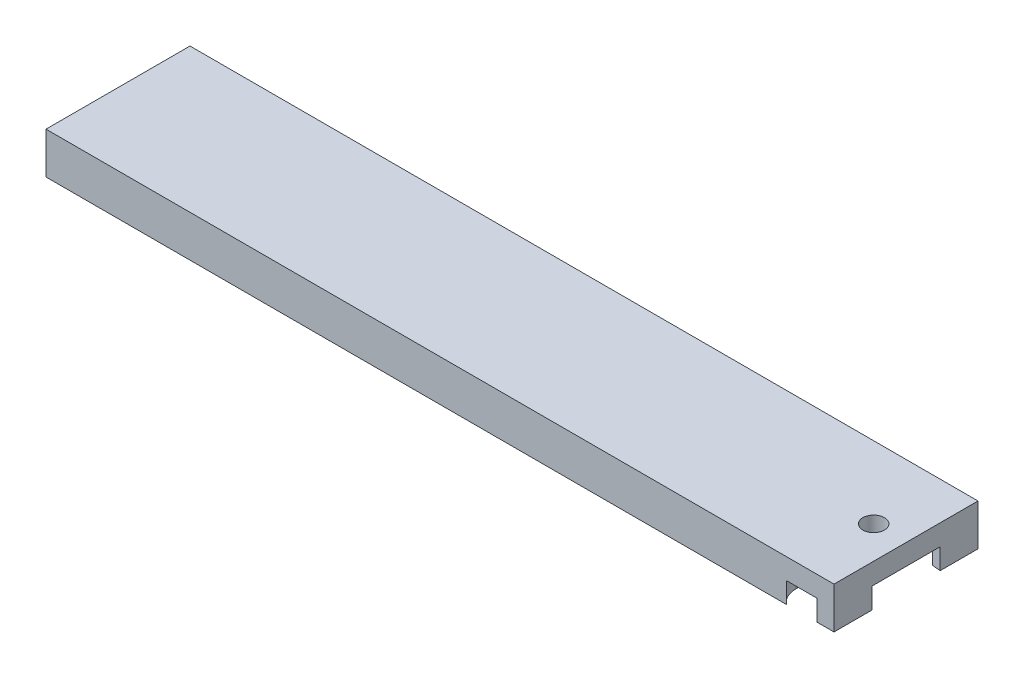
ISO-10303-21;
HEADER;
FILE_DESCRIPTION(('STEP AP214'),'2;1');
FILE_NAME('part.step','',(''),(''),'','','');
FILE_SCHEMA(('AUTOMOTIVE_DESIGN { 1 0 10303 214 1 1 1 1 }'));
ENDSEC;
DATA;
#1=APPLICATION_CONTEXT('core data for automotive mechanical design processes');
#2=APPLICATION_PROTOCOL_DEFINITION('international standard','automotive_design',2000,#1);
#3=PRODUCT_CONTEXT('',#1,'mechanical');
#4=PRODUCT('Part','Part','',(#3));
#5=PRODUCT_RELATED_PRODUCT_CATEGORY('part','',(#4));
#6=PRODUCT_DEFINITION_FORMATION('','',#4);
#7=PRODUCT_DEFINITION_CONTEXT('part definition',#1,'design');
#8=PRODUCT_DEFINITION('design','',#6,#7);
#9=PRODUCT_DEFINITION_SHAPE('','',#8);
#10=(LENGTH_UNIT() NAMED_UNIT(*) SI_UNIT(.MILLI.,.METRE.));
#11=(NAMED_UNIT(*) PLANE_ANGLE_UNIT() SI_UNIT($,.RADIAN.));
#12=(NAMED_UNIT(*) SI_UNIT($,.STERADIAN.) SOLID_ANGLE_UNIT());
#13=UNCERTAINTY_MEASURE_WITH_UNIT(LENGTH_MEASURE(1.E-05),#10,'distance_accuracy_value','');
#14=(GEOMETRIC_REPRESENTATION_CONTEXT(3) GLOBAL_UNCERTAINTY_ASSIGNED_CONTEXT((#13)) GLOBAL_UNIT_ASSIGNED_CONTEXT((#10,
#11,#12)) REPRESENTATION_CONTEXT('',''));
#15=CARTESIAN_POINT('',(0.,0.,0.));
#16=DIRECTION('',(0.,0.,1.));
#17=DIRECTION('',(1.,0.,0.));
#18=AXIS2_PLACEMENT_3D('',#15,#16,#17);
#19=CARTESIAN_POINT('',(0.,5.,-6.45));
#20=DIRECTION('',(0.,-1.,0.));
#21=DIRECTION('',(0.,0.,-1.));
#22=AXIS2_PLACEMENT_3D('',#19,#20,#21);
#23=CYLINDRICAL_SURFACE('',#22,2.9);
#24=DIRECTION('',(0.,-1.,0.));
#25=VECTOR('',#24,1.);
#26=CARTESIAN_POINT('',(-1.85415226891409,5.,-8.67982496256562));
#27=LINE('',#26,#25);
#28=CARTESIAN_POINT('',(-1.85415226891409,2.5,-8.67982496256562));
#29=VERTEX_POINT('',#28);
#30=CARTESIAN_POINT('',(-1.85415226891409,0.,-8.67982496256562));
#31=VERTEX_POINT('',#30);
#32=EDGE_CURVE('E278',#29,#31,#27,.T.);
#33=ORIENTED_EDGE('',*,*,#32,.F.);
#34=CARTESIAN_POINT('',(0.,2.5,-6.45));
#35=DIRECTION('',(0.,1.,0.));
#36=DIRECTION('',(0.,0.,1.));
#37=AXIS2_PLACEMENT_3D('',#34,#35,#36);
#38=CIRCLE('',#37,2.9);
#39=CARTESIAN_POINT('',(-2.9,2.5,-6.45));
#40=VERTEX_POINT('',#39);
#41=EDGE_CURVE('E232',#29,#40,#38,.T.);
#42=ORIENTED_EDGE('',*,*,#41,.T.);
#43=DIRECTION('',(0.,-1.,0.));
#44=VECTOR('',#43,1.);
#45=CARTESIAN_POINT('',(-2.9,5.,-6.45));
#46=LINE('',#45,#44);
#47=CARTESIAN_POINT('',(-2.9,0.,-6.45));
#48=VERTEX_POINT('',#47);
#49=EDGE_CURVE('E242',#40,#48,#46,.T.);
#50=ORIENTED_EDGE('',*,*,#49,.T.);
#51=CARTESIAN_POINT('',(0.,0.,-6.45));
#52=DIRECTION('',(0.,1.,0.));
#53=DIRECTION('',(0.,0.,1.));
#54=AXIS2_PLACEMENT_3D('',#51,#52,#53);
#55=CIRCLE('',#54,2.9);
#56=EDGE_CURVE('E234',#31,#48,#55,.T.);
#57=ORIENTED_EDGE('',*,*,#56,.F.);
#58=EDGE_LOOP('',(#33,#42,#50,#57));
#59=FACE_BOUND('',#58,.T.);
#60=ADVANCED_FACE('F43',(#59),#23,.F.);
#61=CARTESIAN_POINT('',(0.,5.,6.45));
#62=DIRECTION('',(0.,-1.,0.));
#63=DIRECTION('',(0.,0.,-1.));
#64=AXIS2_PLACEMENT_3D('',#61,#62,#63);
#65=CYLINDRICAL_SURFACE('',#64,2.9);
#66=DIRECTION('',(0.,-1.,0.));
#67=VECTOR('',#66,1.);
#68=CARTESIAN_POINT('',(-2.9,5.,6.45));
#69=LINE('',#68,#67);
#70=CARTESIAN_POINT('',(-2.9,2.5,6.45));
#71=VERTEX_POINT('',#70);
#72=CARTESIAN_POINT('',(-2.9,0.,6.45));
#73=VERTEX_POINT('',#72);
#74=EDGE_CURVE('E268',#71,#73,#69,.T.);
#75=ORIENTED_EDGE('',*,*,#74,.F.);
#76=CARTESIAN_POINT('',(0.,2.5,6.45));
#77=DIRECTION('',(0.,1.,0.));
#78=DIRECTION('',(0.,0.,1.));
#79=AXIS2_PLACEMENT_3D('',#76,#77,#78);
#80=CIRCLE('',#79,2.9);
#81=CARTESIAN_POINT('',(-1.85415226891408,2.5,8.67982496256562));
#82=VERTEX_POINT('',#81);
#83=EDGE_CURVE('E230',#71,#82,#80,.T.);
#84=ORIENTED_EDGE('',*,*,#83,.T.);
#85=DIRECTION('',(0.,-1.,0.));
#86=VECTOR('',#85,1.);
#87=CARTESIAN_POINT('',(-1.85415226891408,5.,8.67982496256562));
#88=LINE('',#87,#86);
#89=CARTESIAN_POINT('',(-1.85415226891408,0.,8.67982496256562));
#90=VERTEX_POINT('',#89);
#91=EDGE_CURVE('E270',#82,#90,#88,.T.);
#92=ORIENTED_EDGE('',*,*,#91,.T.);
#93=CARTESIAN_POINT('',(0.,0.,6.45));
#94=DIRECTION('',(0.,1.,0.));
#95=DIRECTION('',(0.,0.,1.));
#96=AXIS2_PLACEMENT_3D('',#93,#94,#95);
#97=CIRCLE('',#96,2.9);
#98=EDGE_CURVE('E252',#73,#90,#97,.T.);
#99=ORIENTED_EDGE('',*,*,#98,.F.);
#100=EDGE_LOOP('',(#75,#84,#92,#99));
#101=FACE_BOUND('',#100,.T.);
#102=ADVANCED_FACE('F395',(#101),#65,.F.);
#103=CARTESIAN_POINT('',(-2.9,5.,0.));
#104=DIRECTION('',(1.,0.,0.));
#105=DIRECTION('',(0.,0.,-1.));
#106=AXIS2_PLACEMENT_3D('',#103,#104,#105);
#107=PLANE('',#106);
#108=DIRECTION('',(0.,-1.,0.));
#109=VECTOR('',#108,1.);
#110=CARTESIAN_POINT('',(-2.9,5.,3.61373784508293));
#111=LINE('',#110,#109);
#112=CARTESIAN_POINT('',(-2.9,2.5,3.61373784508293));
#113=VERTEX_POINT('',#112);
#114=CARTESIAN_POINT('',(-2.9,0.,3.61373784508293));
#115=VERTEX_POINT('',#114);
#116=EDGE_CURVE('E266',#113,#115,#111,.T.);
#117=ORIENTED_EDGE('',*,*,#116,.F.);
#118=DIRECTION('',(0.,0.,1.));
#119=VECTOR('',#118,1.);
#120=CARTESIAN_POINT('',(-2.9,2.5,0.));
#121=LINE('',#120,#119);
#122=EDGE_CURVE('E228',#113,#71,#121,.T.);
#123=ORIENTED_EDGE('',*,*,#122,.T.);
#124=ORIENTED_EDGE('',*,*,#74,.T.);
#125=DIRECTION('',(0.,0.,1.));
#126=VECTOR('',#125,1.);
#127=CARTESIAN_POINT('',(-2.9,0.,0.));
#128=LINE('',#127,#126);
#129=EDGE_CURVE('E255',#115,#73,#128,.T.);
#130=ORIENTED_EDGE('',*,*,#129,.F.);
#131=EDGE_LOOP('',(#117,#123,#124,#130));
#132=FACE_BOUND('',#131,.T.);
#133=ADVANCED_FACE('F399',(#132),#107,.T.);
#134=CARTESIAN_POINT('',(-0.205508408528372,5.,3.76097126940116));
#135=DIRECTION('',(0.0545609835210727,0.,-0.998510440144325));
#136=DIRECTION('',(-0.998510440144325,0.,-0.0545609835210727));
#137=AXIS2_PLACEMENT_3D('',#134,#135,#136);
#138=PLANE('',#137);
#139=DIRECTION('',(0.998510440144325,0.,0.0545609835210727));
#140=VECTOR('',#139,1.);
#141=CARTESIAN_POINT('',(-0.205508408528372,0.,3.76097126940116));
#142=LINE('',#141,#140);
#143=CARTESIAN_POINT('',(-21.7136829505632,0.,2.58571349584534));
#144=VERTEX_POINT('',#143);
#145=EDGE_CURVE('E258',#144,#115,#142,.T.);
#146=ORIENTED_EDGE('',*,*,#145,.F.);
#147=DIRECTION('',(0.,-1.,0.));
#148=VECTOR('',#147,1.);
#149=CARTESIAN_POINT('',(-21.7136829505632,14.2309184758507,2.58571349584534));
#150=LINE('',#149,#148);
#151=CARTESIAN_POINT('',(-21.7136829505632,2.5,2.58571349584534));
#152=VERTEX_POINT('',#151);
#153=EDGE_CURVE('E362',#152,#144,#150,.T.);
#154=ORIENTED_EDGE('',*,*,#153,.F.);
#155=DIRECTION('',(0.998510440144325,0.,0.0545609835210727));
#156=VECTOR('',#155,1.);
#157=CARTESIAN_POINT('',(-0.205508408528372,2.5,3.76097126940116));
#158=LINE('',#157,#156);
#159=EDGE_CURVE('E226',#152,#113,#158,.T.);
#160=ORIENTED_EDGE('',*,*,#159,.T.);
#161=ORIENTED_EDGE('',*,*,#116,.T.);
#162=EDGE_LOOP('',(#146,#154,#160,#161));
#163=FACE_BOUND('',#162,.T.);
#164=ADVANCED_FACE('F406',(#163),#138,.T.);
#165=CARTESIAN_POINT('',(-0.205508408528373,5.,-3.76097126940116));
#166=DIRECTION('',(0.0545609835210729,0.,0.998510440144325));
#167=DIRECTION('',(0.998510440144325,0.,-0.0545609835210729));
#168=AXIS2_PLACEMENT_3D('',#165,#166,#167);
#169=PLANE('',#168);
#170=DIRECTION('',(0.,-1.,0.));
#171=VECTOR('',#170,1.);
#172=CARTESIAN_POINT('',(-2.9,5.,-3.61373784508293));
#173=LINE('',#172,#171);
#174=CARTESIAN_POINT('',(-2.9,2.5,-3.61373784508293));
#175=VERTEX_POINT('',#174);
#176=CARTESIAN_POINT('',(-2.9,0.,-3.61373784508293));
#177=VERTEX_POINT('',#176);
#178=EDGE_CURVE('E264',#175,#177,#173,.T.);
#179=ORIENTED_EDGE('',*,*,#178,.F.);
#180=DIRECTION('',(-0.998510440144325,0.,0.0545609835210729));
#181=VECTOR('',#180,1.);
#182=CARTESIAN_POINT('',(-0.205508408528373,2.5,-3.76097126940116));
#183=LINE('',#182,#181);
#184=CARTESIAN_POINT('',(-21.7136829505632,2.5,-2.58571349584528));
#185=VERTEX_POINT('',#184);
#186=EDGE_CURVE('E224',#175,#185,#183,.T.);
#187=ORIENTED_EDGE('',*,*,#186,.T.);
#188=DIRECTION('',(0.,-1.,0.));
#189=VECTOR('',#188,1.);
#190=CARTESIAN_POINT('',(-21.7136829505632,14.2309184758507,-2.58571349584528));
#191=LINE('',#190,#189);
#192=CARTESIAN_POINT('',(-21.7136829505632,0.,-2.58571349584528));
#193=VERTEX_POINT('',#192);
#194=EDGE_CURVE('E347',#185,#193,#191,.T.);
#195=ORIENTED_EDGE('',*,*,#194,.T.);
#196=DIRECTION('',(-0.998510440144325,0.,0.0545609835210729));
#197=VECTOR('',#196,1.);
#198=CARTESIAN_POINT('',(-0.205508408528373,0.,-3.76097126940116));
#199=LINE('',#198,#197);
#200=EDGE_CURVE('E66',#177,#193,#199,.T.);
#201=ORIENTED_EDGE('',*,*,#200,.F.);
#202=EDGE_LOOP('',(#179,#187,#195,#201));
#203=FACE_BOUND('',#202,.T.);
#204=ADVANCED_FACE('F344',(#203),#169,.T.);
#205=CARTESIAN_POINT('',(-2.9,5.,0.));
#206=DIRECTION('',(1.,0.,0.));
#207=DIRECTION('',(0.,0.,-1.));
#208=AXIS2_PLACEMENT_3D('',#205,#206,#207);
#209=PLANE('',#208);
#210=ORIENTED_EDGE('',*,*,#49,.F.);
#211=DIRECTION('',(0.,0.,1.));
#212=VECTOR('',#211,1.);
#213=CARTESIAN_POINT('',(-2.9,2.5,0.));
#214=LINE('',#213,#212);
#215=EDGE_CURVE('E280',#40,#175,#214,.T.);
#216=ORIENTED_EDGE('',*,*,#215,.T.);
#217=ORIENTED_EDGE('',*,*,#178,.T.);
#218=DIRECTION('',(0.,0.,1.));
#219=VECTOR('',#218,1.);
#220=CARTESIAN_POINT('',(-2.9,0.,0.));
#221=LINE('',#220,#219);
#222=EDGE_CURVE('E237',#48,#177,#221,.T.);
#223=ORIENTED_EDGE('',*,*,#222,.F.);
#224=EDGE_LOOP('',(#210,#216,#217,#223));
#225=FACE_BOUND('',#224,.T.);
#226=ADVANCED_FACE('F341',(#225),#209,.T.);
#227=CARTESIAN_POINT('',(0.,5.,-8.67982496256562));
#228=DIRECTION('',(0.,0.,1.));
#229=DIRECTION('',(1.,0.,0.));
#230=AXIS2_PLACEMENT_3D('',#227,#228,#229);
#231=PLANE('',#230);
#232=DIRECTION('',(-1.,0.,0.));
#233=VECTOR('',#232,1.);
#234=CARTESIAN_POINT('',(0.,5.,-8.67982496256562));
#235=LINE('',#234,#233);
#236=CARTESIAN_POINT('',(3.9,5.,-8.67982496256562));
#237=VERTEX_POINT('',#236);
#238=CARTESIAN_POINT('',(-91.1,5.,-8.6798249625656));
#239=VERTEX_POINT('',#238);
#240=EDGE_CURVE('E198',#237,#239,#235,.T.);
#241=ORIENTED_EDGE('',*,*,#240,.F.);
#242=DIRECTION('',(0.,-1.,0.));
#243=VECTOR('',#242,1.);
#244=CARTESIAN_POINT('',(3.9,10.,-8.67982496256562));
#245=LINE('',#244,#243);
#246=CARTESIAN_POINT('',(3.9,0.,-8.67982496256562));
#247=VERTEX_POINT('',#246);
#248=EDGE_CURVE('E183',#237,#247,#245,.T.);
#249=ORIENTED_EDGE('',*,*,#248,.T.);
#250=DIRECTION('',(-1.,0.,0.));
#251=VECTOR('',#250,1.);
#252=CARTESIAN_POINT('',(0.,0.,-8.67982496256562));
#253=LINE('',#252,#251);
#254=CARTESIAN_POINT('',(1.85415226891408,0.,-8.67982496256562));
#255=VERTEX_POINT('',#254);
#256=EDGE_CURVE('E195',#247,#255,#253,.T.);
#257=ORIENTED_EDGE('',*,*,#256,.T.);
#258=DIRECTION('',(0.,-1.,0.));
#259=VECTOR('',#258,1.);
#260=CARTESIAN_POINT('',(1.85415226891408,5.,-8.67982496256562));
#261=LINE('',#260,#259);
#262=CARTESIAN_POINT('',(1.85415226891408,2.5,-8.6798249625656));
#263=VERTEX_POINT('',#262);
#264=EDGE_CURVE('E206',#263,#255,#261,.T.);
#265=ORIENTED_EDGE('',*,*,#264,.F.);
#266=DIRECTION('',(-1.,0.,0.));
#267=VECTOR('',#266,1.);
#268=CARTESIAN_POINT('',(-91.1,2.5,-8.6798249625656));
#269=LINE('',#268,#267);
#270=EDGE_CURVE('E222',#263,#29,#269,.T.);
#271=ORIENTED_EDGE('',*,*,#270,.T.);
#272=ORIENTED_EDGE('',*,*,#32,.T.);
#273=DIRECTION('',(-1.,0.,0.));
#274=VECTOR('',#273,1.);
#275=CARTESIAN_POINT('',(0.,0.,-8.67982496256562));
#276=LINE('',#275,#274);
#277=CARTESIAN_POINT('',(-91.1,0.,-8.6798249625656));
#278=VERTEX_POINT('',#277);
#279=EDGE_CURVE('E245',#31,#278,#276,.T.);
#280=ORIENTED_EDGE('',*,*,#279,.T.);
#281=DIRECTION('',(0.,-1.,0.));
#282=VECTOR('',#281,1.);
#283=CARTESIAN_POINT('',(-91.1,5.,-8.6798249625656));
#284=LINE('',#283,#282);
#285=EDGE_CURVE('E275',#239,#278,#284,.T.);
#286=ORIENTED_EDGE('',*,*,#285,.F.);
#287=EDGE_LOOP('',(#241,#249,#257,#265,#271,#272,#280,#286));
#288=FACE_BOUND('',#287,.T.);
#289=ADVANCED_FACE('F194',(#288),#231,.F.);
#290=CARTESIAN_POINT('',(-91.1,5.,0.));
#291=DIRECTION('',(1.,0.,0.));
#292=DIRECTION('',(0.,0.,-1.));
#293=AXIS2_PLACEMENT_3D('',#290,#291,#292);
#294=PLANE('',#293);
#295=ORIENTED_EDGE('',*,*,#285,.T.);
#296=DIRECTION('',(0.,0.,1.));
#297=VECTOR('',#296,1.);
#298=CARTESIAN_POINT('',(-91.1,0.,0.));
#299=LINE('',#298,#297);
#300=CARTESIAN_POINT('',(-91.1,0.,8.67982496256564));
#301=VERTEX_POINT('',#300);
#302=EDGE_CURVE('E247',#278,#301,#299,.T.);
#303=ORIENTED_EDGE('',*,*,#302,.T.);
#304=DIRECTION('',(0.,-1.,0.));
#305=VECTOR('',#304,1.);
#306=CARTESIAN_POINT('',(-91.1,5.,8.67982496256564));
#307=LINE('',#306,#305);
#308=CARTESIAN_POINT('',(-91.1,5.,8.67982496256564));
#309=VERTEX_POINT('',#308);
#310=EDGE_CURVE('E273',#309,#301,#307,.T.);
#311=ORIENTED_EDGE('',*,*,#310,.F.);
#312=DIRECTION('',(0.,0.,1.));
#313=VECTOR('',#312,1.);
#314=CARTESIAN_POINT('',(-91.1,5.,0.));
#315=LINE('',#314,#313);
#316=EDGE_CURVE('E236',#239,#309,#315,.T.);
#317=ORIENTED_EDGE('',*,*,#316,.F.);
#318=EDGE_LOOP('',(#295,#303,#311,#317));
#319=FACE_BOUND('',#318,.T.);
#320=ADVANCED_FACE('F353',(#319),#294,.F.);
#321=CARTESIAN_POINT('',(0.,5.,8.67982496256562));
#322=DIRECTION('',(0.,0.,-1.));
#323=DIRECTION('',(-1.,0.,0.));
#324=AXIS2_PLACEMENT_3D('',#321,#322,#323);
#325=PLANE('',#324);
#326=DIRECTION('',(1.,0.,0.));
#327=VECTOR('',#326,1.);
#328=CARTESIAN_POINT('',(0.,0.,8.67982496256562));
#329=LINE('',#328,#327);
#330=CARTESIAN_POINT('',(1.85415226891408,0.,8.67982496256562));
#331=VERTEX_POINT('',#330);
#332=CARTESIAN_POINT('',(3.9,0.,8.67982496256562));
#333=VERTEX_POINT('',#332);
#334=EDGE_CURVE('E378',#331,#333,#329,.T.);
#335=ORIENTED_EDGE('',*,*,#334,.T.);
#336=DIRECTION('',(0.,-1.,0.));
#337=VECTOR('',#336,1.);
#338=CARTESIAN_POINT('',(3.9,10.,8.67982496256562));
#339=LINE('',#338,#337);
#340=CARTESIAN_POINT('',(3.9,5.,8.67982496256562));
#341=VERTEX_POINT('',#340);
#342=EDGE_CURVE('E58',#341,#333,#339,.T.);
#343=ORIENTED_EDGE('',*,*,#342,.F.);
#344=DIRECTION('',(1.,0.,0.));
#345=VECTOR('',#344,1.);
#346=CARTESIAN_POINT('',(0.,5.,8.67982496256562));
#347=LINE('',#346,#345);
#348=EDGE_CURVE('E239',#309,#341,#347,.T.);
#349=ORIENTED_EDGE('',*,*,#348,.F.);
#350=ORIENTED_EDGE('',*,*,#310,.T.);
#351=DIRECTION('',(1.,0.,0.));
#352=VECTOR('',#351,1.);
#353=CARTESIAN_POINT('',(0.,0.,8.67982496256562));
#354=LINE('',#353,#352);
#355=EDGE_CURVE('E250',#301,#90,#354,.T.);
#356=ORIENTED_EDGE('',*,*,#355,.T.);
#357=ORIENTED_EDGE('',*,*,#91,.F.);
#358=DIRECTION('',(1.,0.,0.));
#359=VECTOR('',#358,1.);
#360=CARTESIAN_POINT('',(-91.1,2.5,8.67982496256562));
#361=LINE('',#360,#359);
#362=CARTESIAN_POINT('',(1.85415226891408,2.5,8.67982496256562));
#363=VERTEX_POINT('',#362);
#364=EDGE_CURVE('E219',#82,#363,#361,.T.);
#365=ORIENTED_EDGE('',*,*,#364,.T.);
#366=DIRECTION('',(0.,-1.,0.));
#367=VECTOR('',#366,1.);
#368=CARTESIAN_POINT('',(1.85415226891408,5.,8.67982496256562));
#369=LINE('',#368,#367);
#370=EDGE_CURVE('E314',#363,#331,#369,.T.);
#371=ORIENTED_EDGE('',*,*,#370,.T.);
#372=EDGE_LOOP('',(#335,#343,#349,#350,#356,#357,#365,#371));
#373=FACE_BOUND('',#372,.T.);
#374=ADVANCED_FACE('F391',(#373),#325,.F.);
#375=CARTESIAN_POINT('',(0.,5.,0.));
#376=DIRECTION('',(0.,1.,0.));
#377=DIRECTION('',(0.,0.,1.));
#378=AXIS2_PLACEMENT_3D('',#375,#376,#377);
#379=PLANE('',#378);
#380=DIRECTION('',(0.,0.,1.));
#381=VECTOR('',#380,1.);
#382=CARTESIAN_POINT('',(3.9,5.,0.));
#383=LINE('',#382,#381);
#384=EDGE_CURVE('E359',#237,#341,#383,.T.);
#385=ORIENTED_EDGE('',*,*,#384,.F.);
#386=ORIENTED_EDGE('',*,*,#240,.T.);
#387=ORIENTED_EDGE('',*,*,#316,.T.);
#388=ORIENTED_EDGE('',*,*,#348,.T.);
#389=EDGE_LOOP('',(#385,#386,#387,#388));
#390=FACE_BOUND('',#389,.T.);
#391=CARTESIAN_POINT('',(0.,5.,0.));
#392=DIRECTION('',(0.,-1.,0.));
#393=DIRECTION('',(0.,0.,-1.));
#394=AXIS2_PLACEMENT_3D('',#391,#392,#393);
#395=CIRCLE('',#394,1.3);
#396=CARTESIAN_POINT('',(0.,5.,-1.3));
#397=VERTEX_POINT('',#396);
#398=EDGE_CURVE('E370',#397,#397,#395,.T.);
#399=ORIENTED_EDGE('',*,*,#398,.T.);
#400=EDGE_LOOP('',(#399));
#401=FACE_BOUND('',#400,.T.);
#402=ADVANCED_FACE('F357',(#390,#401),#379,.T.);
#403=CARTESIAN_POINT('',(0.,0.,0.));
#404=DIRECTION('',(0.,1.,0.));
#405=DIRECTION('',(0.,0.,1.));
#406=AXIS2_PLACEMENT_3D('',#403,#404,#405);
#407=PLANE('',#406);
#408=CARTESIAN_POINT('',(-21.7136829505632,0.,0.));
#409=DIRECTION('',(0.,-1.,0.));
#410=DIRECTION('',(0.,0.,-1.));
#411=AXIS2_PLACEMENT_3D('',#408,#409,#410);
#412=CIRCLE('',#411,2.58571349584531);
#413=EDGE_CURVE('E360',#144,#193,#412,.T.);
#414=ORIENTED_EDGE('',*,*,#413,.F.);
#415=ORIENTED_EDGE('',*,*,#145,.T.);
#416=ORIENTED_EDGE('',*,*,#129,.T.);
#417=ORIENTED_EDGE('',*,*,#98,.T.);
#418=ORIENTED_EDGE('',*,*,#355,.F.);
#419=ORIENTED_EDGE('',*,*,#302,.F.);
#420=ORIENTED_EDGE('',*,*,#279,.F.);
#421=ORIENTED_EDGE('',*,*,#56,.T.);
#422=ORIENTED_EDGE('',*,*,#222,.T.);
#423=ORIENTED_EDGE('',*,*,#200,.T.);
#424=EDGE_LOOP('',(#414,#415,#416,#417,#418,#419,#420,#421,#422,#423));
#425=FACE_BOUND('',#424,.T.);
#426=ADVANCED_FACE('F348',(#425),#407,.F.);
#427=CARTESIAN_POINT('',(0.,2.5,0.));
#428=DIRECTION('',(0.,1.,0.));
#429=DIRECTION('',(0.,0.,1.));
#430=AXIS2_PLACEMENT_3D('',#427,#428,#429);
#431=PLANE('',#430);
#432=CARTESIAN_POINT('',(0.,2.5,0.));
#433=DIRECTION('',(0.,1.,0.));
#434=DIRECTION('',(0.,0.,1.));
#435=AXIS2_PLACEMENT_3D('',#432,#433,#434);
#436=CIRCLE('',#435,1.3);
#437=CARTESIAN_POINT('',(0.,2.5,1.3));
#438=VERTEX_POINT('',#437);
#439=EDGE_CURVE('E46',#438,#438,#436,.T.);
#440=ORIENTED_EDGE('',*,*,#439,.T.);
#441=EDGE_LOOP('',(#440));
#442=FACE_BOUND('',#441,.T.);
#443=DIRECTION('',(0.996107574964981,0.,0.0881458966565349));
#444=VECTOR('',#443,1.);
#445=CARTESIAN_POINT('',(0.39224924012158,2.5,-4.43267870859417));
#446=LINE('',#445,#444);
#447=CARTESIAN_POINT('',(2.9,2.5,-4.21076699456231));
#448=VERTEX_POINT('',#447);
#449=CARTESIAN_POINT('',(3.9,2.5,-4.1222766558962));
#450=VERTEX_POINT('',#449);
#451=EDGE_CURVE('E282',#448,#450,#446,.T.);
#452=ORIENTED_EDGE('',*,*,#451,.T.);
#453=DIRECTION('',(0.,0.,1.));
#454=VECTOR('',#453,1.);
#455=CARTESIAN_POINT('',(3.9,2.5,0.));
#456=LINE('',#455,#454);
#457=CARTESIAN_POINT('',(3.9,2.5,4.1222766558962));
#458=VERTEX_POINT('',#457);
#459=EDGE_CURVE('E299',#450,#458,#456,.T.);
#460=ORIENTED_EDGE('',*,*,#459,.T.);
#461=DIRECTION('',(-0.996107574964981,0.,0.0881458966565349));
#462=VECTOR('',#461,1.);
#463=CARTESIAN_POINT('',(0.392249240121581,2.5,4.43267870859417));
#464=LINE('',#463,#462);
#465=CARTESIAN_POINT('',(2.9,2.5,4.21076699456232));
#466=VERTEX_POINT('',#465);
#467=EDGE_CURVE('E51',#458,#466,#464,.T.);
#468=ORIENTED_EDGE('',*,*,#467,.T.);
#469=DIRECTION('',(0.,0.,1.));
#470=VECTOR('',#469,1.);
#471=CARTESIAN_POINT('',(2.9,2.5,0.));
#472=LINE('',#471,#470);
#473=CARTESIAN_POINT('',(2.9,2.5,6.45));
#474=VERTEX_POINT('',#473);
#475=EDGE_CURVE('E291',#466,#474,#472,.T.);
#476=ORIENTED_EDGE('',*,*,#475,.T.);
#477=CARTESIAN_POINT('',(0.,2.5,6.45));
#478=DIRECTION('',(0.,1.,0.));
#479=DIRECTION('',(0.,0.,1.));
#480=AXIS2_PLACEMENT_3D('',#477,#478,#479);
#481=CIRCLE('',#480,2.9);
#482=EDGE_CURVE('E11',#474,#363,#481,.F.);
#483=ORIENTED_EDGE('',*,*,#482,.T.);
#484=ORIENTED_EDGE('',*,*,#364,.F.);
#485=ORIENTED_EDGE('',*,*,#83,.F.);
#486=ORIENTED_EDGE('',*,*,#122,.F.);
#487=ORIENTED_EDGE('',*,*,#159,.F.);
#488=CARTESIAN_POINT('',(-21.7136829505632,2.5,0.));
#489=DIRECTION('',(0.,1.,0.));
#490=DIRECTION('',(0.,0.,1.));
#491=AXIS2_PLACEMENT_3D('',#488,#489,#490);
#492=CIRCLE('',#491,2.58571349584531);
#493=EDGE_CURVE('E367',#152,#185,#492,.F.);
#494=ORIENTED_EDGE('',*,*,#493,.T.);
#495=ORIENTED_EDGE('',*,*,#186,.F.);
#496=ORIENTED_EDGE('',*,*,#215,.F.);
#497=ORIENTED_EDGE('',*,*,#41,.F.);
#498=ORIENTED_EDGE('',*,*,#270,.F.);
#499=CARTESIAN_POINT('',(0.,2.5,-6.45));
#500=DIRECTION('',(0.,1.,0.));
#501=DIRECTION('',(0.,0.,1.));
#502=AXIS2_PLACEMENT_3D('',#499,#500,#501);
#503=CIRCLE('',#502,2.9);
#504=CARTESIAN_POINT('',(2.9,2.5,-6.45));
#505=VERTEX_POINT('',#504);
#506=EDGE_CURVE('E288',#263,#505,#503,.F.);
#507=ORIENTED_EDGE('',*,*,#506,.T.);
#508=DIRECTION('',(0.,0.,1.));
#509=VECTOR('',#508,1.);
#510=CARTESIAN_POINT('',(2.9,2.5,0.));
#511=LINE('',#510,#509);
#512=EDGE_CURVE('E285',#505,#448,#511,.T.);
#513=ORIENTED_EDGE('',*,*,#512,.T.);
#514=EDGE_LOOP('',(#452,#460,#468,#476,#483,#484,#485,#486,#487,#494,#495,#496,#497,#498,#507,#513));
#515=FACE_BOUND('',#514,.T.);
#516=ADVANCED_FACE('F298',(#442,#515),#431,.F.);
#517=CARTESIAN_POINT('',(0.,5.,-6.45));
#518=DIRECTION('',(0.,-1.,0.));
#519=DIRECTION('',(0.,0.,-1.));
#520=AXIS2_PLACEMENT_3D('',#517,#518,#519);
#521=CYLINDRICAL_SURFACE('',#520,2.9);
#522=ORIENTED_EDGE('',*,*,#506,.F.);
#523=ORIENTED_EDGE('',*,*,#264,.T.);
#524=CARTESIAN_POINT('',(0.,0.,-6.45));
#525=DIRECTION('',(0.,1.,0.));
#526=DIRECTION('',(0.,0.,1.));
#527=AXIS2_PLACEMENT_3D('',#524,#525,#526);
#528=CIRCLE('',#527,2.9);
#529=CARTESIAN_POINT('',(2.9,0.,-6.45));
#530=VERTEX_POINT('',#529);
#531=EDGE_CURVE('E205',#530,#255,#528,.T.);
#532=ORIENTED_EDGE('',*,*,#531,.F.);
#533=DIRECTION('',(0.,-1.,0.));
#534=VECTOR('',#533,1.);
#535=CARTESIAN_POINT('',(2.9,5.,-6.45));
#536=LINE('',#535,#534);
#537=EDGE_CURVE('E217',#505,#530,#536,.T.);
#538=ORIENTED_EDGE('',*,*,#537,.F.);
#539=EDGE_LOOP('',(#522,#523,#532,#538));
#540=FACE_BOUND('',#539,.T.);
#541=ADVANCED_FACE('F328',(#540),#521,.F.);
#542=CARTESIAN_POINT('',(2.9,5.,0.));
#543=DIRECTION('',(-1.,0.,0.));
#544=DIRECTION('',(0.,0.,1.));
#545=AXIS2_PLACEMENT_3D('',#542,#543,#544);
#546=PLANE('',#545);
#547=ORIENTED_EDGE('',*,*,#512,.F.);
#548=ORIENTED_EDGE('',*,*,#537,.T.);
#549=DIRECTION('',(0.,0.,-1.));
#550=VECTOR('',#549,1.);
#551=CARTESIAN_POINT('',(2.9,0.,0.));
#552=LINE('',#551,#550);
#553=CARTESIAN_POINT('',(2.9,0.,-4.21076699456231));
#554=VERTEX_POINT('',#553);
#555=EDGE_CURVE('E211',#554,#530,#552,.T.);
#556=ORIENTED_EDGE('',*,*,#555,.F.);
#557=DIRECTION('',(0.,-1.,0.));
#558=VECTOR('',#557,1.);
#559=CARTESIAN_POINT('',(2.9,5.,-4.21076699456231));
#560=LINE('',#559,#558);
#561=EDGE_CURVE('E209',#448,#554,#560,.T.);
#562=ORIENTED_EDGE('',*,*,#561,.F.);
#563=EDGE_LOOP('',(#547,#548,#556,#562));
#564=FACE_BOUND('',#563,.T.);
#565=ADVANCED_FACE('F324',(#564),#546,.T.);
#566=CARTESIAN_POINT('',(0.39224924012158,5.,-4.43267870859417));
#567=DIRECTION('',(-0.0881458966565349,0.,0.996107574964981));
#568=DIRECTION('',(0.996107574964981,0.,0.0881458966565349));
#569=AXIS2_PLACEMENT_3D('',#566,#567,#568);
#570=PLANE('',#569);
#571=DIRECTION('',(0.,-1.,0.));
#572=VECTOR('',#571,1.);
#573=CARTESIAN_POINT('',(3.9,5.,-4.1222766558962));
#574=LINE('',#573,#572);
#575=CARTESIAN_POINT('',(3.9,0.,-4.1222766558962));
#576=VERTEX_POINT('',#575);
#577=EDGE_CURVE('E186',#450,#576,#574,.T.);
#578=ORIENTED_EDGE('',*,*,#577,.F.);
#579=ORIENTED_EDGE('',*,*,#451,.F.);
#580=ORIENTED_EDGE('',*,*,#561,.T.);
#581=DIRECTION('',(-0.996107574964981,0.,-0.0881458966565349));
#582=VECTOR('',#581,1.);
#583=CARTESIAN_POINT('',(0.39224924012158,0.,-4.43267870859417));
#584=LINE('',#583,#582);
#585=EDGE_CURVE('E207',#576,#554,#584,.T.);
#586=ORIENTED_EDGE('',*,*,#585,.F.);
#587=EDGE_LOOP('',(#578,#579,#580,#586));
#588=FACE_BOUND('',#587,.T.);
#589=ADVANCED_FACE('F447',(#588),#570,.T.);
#590=CARTESIAN_POINT('',(0.,0.,0.));
#591=DIRECTION('',(0.,1.,0.));
#592=DIRECTION('',(0.,0.,1.));
#593=AXIS2_PLACEMENT_3D('',#590,#591,#592);
#594=PLANE('',#593);
#595=ORIENTED_EDGE('',*,*,#256,.F.);
#596=DIRECTION('',(0.,0.,-1.));
#597=VECTOR('',#596,1.);
#598=CARTESIAN_POINT('',(3.9,0.,8.67982496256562));
#599=LINE('',#598,#597);
#600=EDGE_CURVE('E180',#576,#247,#599,.T.);
#601=ORIENTED_EDGE('',*,*,#600,.F.);
#602=ORIENTED_EDGE('',*,*,#585,.T.);
#603=ORIENTED_EDGE('',*,*,#555,.T.);
#604=ORIENTED_EDGE('',*,*,#531,.T.);
#605=EDGE_LOOP('',(#595,#601,#602,#603,#604));
#606=FACE_BOUND('',#605,.T.);
#607=ADVANCED_FACE('F202',(#606),#594,.F.);
#608=CARTESIAN_POINT('',(0.,5.,6.45));
#609=DIRECTION('',(0.,-1.,0.));
#610=DIRECTION('',(0.,0.,-1.));
#611=AXIS2_PLACEMENT_3D('',#608,#609,#610);
#612=CYLINDRICAL_SURFACE('',#611,2.9);
#613=ORIENTED_EDGE('',*,*,#482,.F.);
#614=DIRECTION('',(0.,-1.,0.));
#615=VECTOR('',#614,1.);
#616=CARTESIAN_POINT('',(2.9,5.,6.45));
#617=LINE('',#616,#615);
#618=CARTESIAN_POINT('',(2.9,0.,6.45));
#619=VERTEX_POINT('',#618);
#620=EDGE_CURVE('E308',#474,#619,#617,.T.);
#621=ORIENTED_EDGE('',*,*,#620,.T.);
#622=CARTESIAN_POINT('',(0.,0.,6.45));
#623=DIRECTION('',(0.,1.,0.));
#624=DIRECTION('',(0.,0.,1.));
#625=AXIS2_PLACEMENT_3D('',#622,#623,#624);
#626=CIRCLE('',#625,2.9);
#627=EDGE_CURVE('E375',#331,#619,#626,.T.);
#628=ORIENTED_EDGE('',*,*,#627,.F.);
#629=ORIENTED_EDGE('',*,*,#370,.F.);
#630=EDGE_LOOP('',(#613,#621,#628,#629));
#631=FACE_BOUND('',#630,.T.);
#632=ADVANCED_FACE('F386',(#631),#612,.F.);
#633=CARTESIAN_POINT('',(0.392249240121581,5.,4.43267870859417));
#634=DIRECTION('',(-0.0881458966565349,0.,-0.996107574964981));
#635=DIRECTION('',(-0.996107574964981,0.,0.0881458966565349));
#636=AXIS2_PLACEMENT_3D('',#633,#634,#635);
#637=PLANE('',#636);
#638=DIRECTION('',(0.,1.,0.));
#639=VECTOR('',#638,1.);
#640=CARTESIAN_POINT('',(3.9,5.,4.1222766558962));
#641=LINE('',#640,#639);
#642=CARTESIAN_POINT('',(3.9,0.,4.1222766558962));
#643=VERTEX_POINT('',#642);
#644=EDGE_CURVE('E199',#643,#458,#641,.T.);
#645=ORIENTED_EDGE('',*,*,#644,.F.);
#646=DIRECTION('',(0.996107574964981,0.,-0.0881458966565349));
#647=VECTOR('',#646,1.);
#648=CARTESIAN_POINT('',(0.392249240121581,0.,4.43267870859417));
#649=LINE('',#648,#647);
#650=CARTESIAN_POINT('',(2.9,0.,4.21076699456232));
#651=VERTEX_POINT('',#650);
#652=EDGE_CURVE('E312',#651,#643,#649,.T.);
#653=ORIENTED_EDGE('',*,*,#652,.F.);
#654=DIRECTION('',(0.,-1.,0.));
#655=VECTOR('',#654,1.);
#656=CARTESIAN_POINT('',(2.9,5.,4.21076699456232));
#657=LINE('',#656,#655);
#658=EDGE_CURVE('E306',#466,#651,#657,.T.);
#659=ORIENTED_EDGE('',*,*,#658,.F.);
#660=ORIENTED_EDGE('',*,*,#467,.F.);
#661=EDGE_LOOP('',(#645,#653,#659,#660));
#662=FACE_BOUND('',#661,.T.);
#663=ADVANCED_FACE('F310',(#662),#637,.T.);
#664=CARTESIAN_POINT('',(2.9,5.,0.));
#665=DIRECTION('',(-1.,0.,0.));
#666=DIRECTION('',(0.,0.,1.));
#667=AXIS2_PLACEMENT_3D('',#664,#665,#666);
#668=PLANE('',#667);
#669=ORIENTED_EDGE('',*,*,#475,.F.);
#670=ORIENTED_EDGE('',*,*,#658,.T.);
#671=DIRECTION('',(0.,0.,-1.));
#672=VECTOR('',#671,1.);
#673=CARTESIAN_POINT('',(2.9,0.,0.));
#674=LINE('',#673,#672);
#675=EDGE_CURVE('E317',#619,#651,#674,.T.);
#676=ORIENTED_EDGE('',*,*,#675,.F.);
#677=ORIENTED_EDGE('',*,*,#620,.F.);
#678=EDGE_LOOP('',(#669,#670,#676,#677));
#679=FACE_BOUND('',#678,.T.);
#680=ADVANCED_FACE('F304',(#679),#668,.T.);
#681=CARTESIAN_POINT('',(0.,0.,0.));
#682=DIRECTION('',(0.,1.,0.));
#683=DIRECTION('',(0.,0.,1.));
#684=AXIS2_PLACEMENT_3D('',#681,#682,#683);
#685=PLANE('',#684);
#686=ORIENTED_EDGE('',*,*,#652,.T.);
#687=EDGE_CURVE('E190',#333,#643,#599,.T.);
#688=ORIENTED_EDGE('',*,*,#687,.F.);
#689=ORIENTED_EDGE('',*,*,#334,.F.);
#690=ORIENTED_EDGE('',*,*,#627,.T.);
#691=ORIENTED_EDGE('',*,*,#675,.T.);
#692=EDGE_LOOP('',(#686,#688,#689,#690,#691));
#693=FACE_BOUND('',#692,.T.);
#694=ADVANCED_FACE('F382',(#693),#685,.F.);
#695=CARTESIAN_POINT('',(0.,5.,0.));
#696=DIRECTION('',(0.,-1.,0.));
#697=DIRECTION('',(0.,0.,-1.));
#698=AXIS2_PLACEMENT_3D('',#695,#696,#697);
#699=CYLINDRICAL_SURFACE('',#698,1.3);
#700=ORIENTED_EDGE('',*,*,#398,.F.);
#701=EDGE_LOOP('',(#700));
#702=FACE_BOUND('',#701,.T.);
#703=ORIENTED_EDGE('',*,*,#439,.F.);
#704=EDGE_LOOP('',(#703));
#705=FACE_BOUND('',#704,.T.);
#706=ADVANCED_FACE('F461',(#702,#705),#699,.F.);
#707=CARTESIAN_POINT('',(-21.7136829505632,14.2309184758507,0.));
#708=DIRECTION('',(0.,-1.,0.));
#709=DIRECTION('',(0.,0.,-1.));
#710=AXIS2_PLACEMENT_3D('',#707,#708,#709);
#711=CYLINDRICAL_SURFACE('',#710,2.58571349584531);
#712=ORIENTED_EDGE('',*,*,#153,.T.);
#713=ORIENTED_EDGE('',*,*,#413,.T.);
#714=ORIENTED_EDGE('',*,*,#194,.F.);
#715=ORIENTED_EDGE('',*,*,#493,.F.);
#716=EDGE_LOOP('',(#712,#713,#714,#715));
#717=FACE_BOUND('',#716,.T.);
#718=ADVANCED_FACE('F405',(#717),#711,.F.);
#719=CARTESIAN_POINT('',(3.9,10.,8.67982496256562));
#720=DIRECTION('',(-1.,0.,0.));
#721=DIRECTION('',(0.,0.,1.));
#722=AXIS2_PLACEMENT_3D('',#719,#720,#721);
#723=PLANE('',#722);
#724=ORIENTED_EDGE('',*,*,#384,.T.);
#725=ORIENTED_EDGE('',*,*,#342,.T.);
#726=ORIENTED_EDGE('',*,*,#687,.T.);
#727=ORIENTED_EDGE('',*,*,#644,.T.);
#728=ORIENTED_EDGE('',*,*,#459,.F.);
#729=ORIENTED_EDGE('',*,*,#577,.T.);
#730=ORIENTED_EDGE('',*,*,#600,.T.);
#731=ORIENTED_EDGE('',*,*,#248,.F.);
#732=EDGE_LOOP('',(#724,#725,#726,#727,#728,#729,#730,#731));
#733=FACE_BOUND('',#732,.T.);
#734=ADVANCED_FACE('F182',(#733),#723,.F.);
#735=CLOSED_SHELL('',(#60,#102,#133,#164,#204,#226,#289,#320,#374,#402,#426,#516,#541,#565,#589,
#607,#632,#663,#680,#694,#706,#718,#734));
#736=MANIFOLD_SOLID_BREP('B2',#735);
#737=ADVANCED_BREP_SHAPE_REPRESENTATION('',(#18,#736),#14);
#738=SHAPE_DEFINITION_REPRESENTATION(#9,#737);
ENDSEC;
END-ISO-10303-21;
